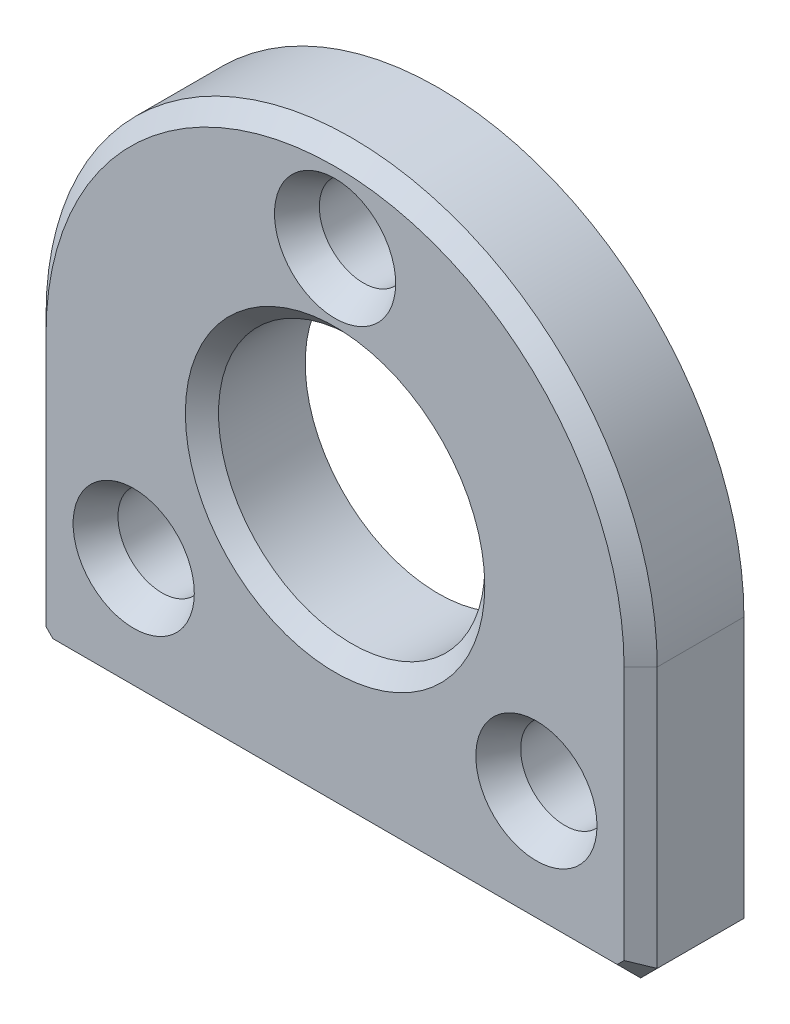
from build123d import *
from OCP.BRepFilletAPI import BRepFilletAPI_MakeChamfer

# Parameters (mm, degrees)
SKETCH_1_R      = 7.1374
SKETCH_1_R_2    = 2.36855
EXTRUDE_1_DEPTH = 5.5372
CHAMFER_1_SIZE  = 0.889
CHAMFER_2_SIZE  = 1.524
CHAMFER_2_SIZE2 = 0.87988181


with BuildPart() as part:
    # Sketch 1 → Extrude 1 (new body)
    with BuildSketch(Plane.XY):
        with BuildLine():
            Line((-16.383, -0.0254), (-16.383, -14.0208))
            Line((-16.383, -14.0208), (-15.494, -14.9098))
            Line((-15.494, -14.9098), (15.494, -14.9098))
            Line((15.494, -14.9098), (16.383, -14.0208))
            Line((16.383, -14.0208), (16.383, -0.0254))
            ThreePointArc((16.383, -0.0254), (0, 16.3576), (-16.383, -0.0254))
        make_face()
        Circle(SKETCH_1_R, mode=Mode.SUBTRACT)
        with Locations((0, 11.6586)):
            Circle(SKETCH_1_R_2, mode=Mode.SUBTRACT)
        with Locations((-10.795, -8.128)):
            Circle(SKETCH_1_R_2, mode=Mode.SUBTRACT)
        with Locations((10.795, -8.128)):
            Circle(SKETCH_1_R_2, mode=Mode.SUBTRACT)
    extrude(amount=EXTRUDE_1_DEPTH)

    # Chamfer 1
    chamfer_1_edges = [part.edges().sort_by_distance(p)[0] for p in [
        (-15.9385, -14.4653, 5.5372),
        (0, -14.9098, 5.5372),
        (15.9385, -14.4653, 5.5372),
        (-7.1374, 0, 5.5372),
        (16.383, -7.0231, 5.5372),
        (0, 16.3576, 5.5372),
        (-16.383, -7.0231, 5.5372),
    ]]
    chamfer(chamfer_1_edges, length=CHAMFER_1_SIZE)

    # Chamfer 2: one chamfer whose edges measure the first distance from different faces: ONE call of the kernel's chamfer builder (chamfer() names one face for all edges)
    chamfer_2_edges_1 = [part.edges().sort_by_distance(p)[0] for p in [
        (-2.36855, 11.6586, 5.5372),
    ]]
    chamfer_2_side_1 = [part.faces().sort_by_distance(p)[0] for p in [
        (-2.36855, 11.6586, 2.7686),
    ]]
    chamfer_2_edges_2 = [part.edges().sort_by_distance(p)[0] for p in [
        (-13.16355, -8.128, 5.5372),
    ]]
    chamfer_2_side_2 = [part.faces().sort_by_distance(p)[0] for p in [
        (-13.16355, -8.128, 2.7686),
    ]]
    chamfer_2_edges_3 = [part.edges().sort_by_distance(p)[0] for p in [
        (8.42645, -8.128, 5.5372),
    ]]
    chamfer_2_side_3 = [part.faces().sort_by_distance(p)[0] for p in [
        (8.42645, -8.128, 2.7686),
    ]]
    chamfer_2 = BRepFilletAPI_MakeChamfer(part.part.solid().wrapped)
    for e in chamfer_2_edges_1:
        chamfer_2.Add(CHAMFER_2_SIZE, CHAMFER_2_SIZE2, e.wrapped, chamfer_2_side_1[0].wrapped)  # the first distance lies on this face
    for e in chamfer_2_edges_2:
        chamfer_2.Add(CHAMFER_2_SIZE, CHAMFER_2_SIZE2, e.wrapped, chamfer_2_side_2[0].wrapped)  # the first distance lies on this face
    for e in chamfer_2_edges_3:
        chamfer_2.Add(CHAMFER_2_SIZE, CHAMFER_2_SIZE2, e.wrapped, chamfer_2_side_3[0].wrapped)  # the first distance lies on this face
    add(Compound.cast(chamfer_2.Shape()), mode=Mode.REPLACE)


solid = part.part
